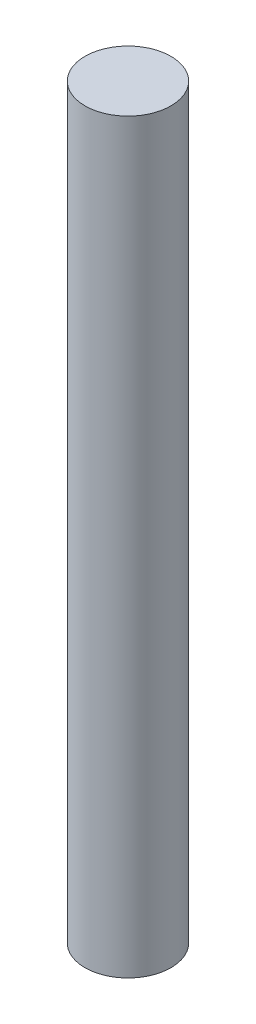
ISO-10303-21;
HEADER;
FILE_DESCRIPTION(('STEP AP214'),'2;1');
FILE_NAME('part.step','',(''),(''),'','','');
FILE_SCHEMA(('AUTOMOTIVE_DESIGN { 1 0 10303 214 1 1 1 1 }'));
ENDSEC;
DATA;
#1=APPLICATION_CONTEXT('core data for automotive mechanical design processes');
#2=APPLICATION_PROTOCOL_DEFINITION('international standard','automotive_design',2000,#1);
#3=PRODUCT_CONTEXT('',#1,'mechanical');
#4=PRODUCT('Part','Part','',(#3));
#5=PRODUCT_RELATED_PRODUCT_CATEGORY('part','',(#4));
#6=PRODUCT_DEFINITION_FORMATION('','',#4);
#7=PRODUCT_DEFINITION_CONTEXT('part definition',#1,'design');
#8=PRODUCT_DEFINITION('design','',#6,#7);
#9=PRODUCT_DEFINITION_SHAPE('','',#8);
#10=(LENGTH_UNIT() NAMED_UNIT(*) SI_UNIT(.MILLI.,.METRE.));
#11=(NAMED_UNIT(*) PLANE_ANGLE_UNIT() SI_UNIT($,.RADIAN.));
#12=(NAMED_UNIT(*) SI_UNIT($,.STERADIAN.) SOLID_ANGLE_UNIT());
#13=UNCERTAINTY_MEASURE_WITH_UNIT(LENGTH_MEASURE(1.E-05),#10,'distance_accuracy_value','');
#14=(GEOMETRIC_REPRESENTATION_CONTEXT(3) GLOBAL_UNCERTAINTY_ASSIGNED_CONTEXT((#13)) GLOBAL_UNIT_ASSIGNED_CONTEXT((#10,
#11,#12)) REPRESENTATION_CONTEXT('',''));
#15=CARTESIAN_POINT('',(0.,0.,0.));
#16=DIRECTION('',(0.,0.,1.));
#17=DIRECTION('',(1.,0.,0.));
#18=AXIS2_PLACEMENT_3D('',#15,#16,#17);
#19=CARTESIAN_POINT('',(0.,220.6625,0.));
#20=DIRECTION('',(0.,-1.,0.));
#21=DIRECTION('',(0.,0.,-1.));
#22=AXIS2_PLACEMENT_3D('',#19,#20,#21);
#23=CYLINDRICAL_SURFACE('',#22,12.7);
#24=CARTESIAN_POINT('',(0.,220.6625,0.));
#25=DIRECTION('',(0.,1.,0.));
#26=DIRECTION('',(0.,0.,1.));
#27=AXIS2_PLACEMENT_3D('',#24,#25,#26);
#28=CIRCLE('',#27,12.7);
#29=CARTESIAN_POINT('',(0.,220.6625,12.7));
#30=VERTEX_POINT('',#29);
#31=EDGE_CURVE('E10',#30,#30,#28,.T.);
#32=ORIENTED_EDGE('',*,*,#31,.F.);
#33=EDGE_LOOP('',(#32));
#34=FACE_BOUND('',#33,.T.);
#35=CARTESIAN_POINT('',(0.,0.,0.));
#36=DIRECTION('',(0.,1.,0.));
#37=DIRECTION('',(0.,0.,1.));
#38=AXIS2_PLACEMENT_3D('',#35,#36,#37);
#39=CIRCLE('',#38,12.7);
#40=CARTESIAN_POINT('',(0.,0.,12.7));
#41=VERTEX_POINT('',#40);
#42=EDGE_CURVE('E35',#41,#41,#39,.T.);
#43=ORIENTED_EDGE('',*,*,#42,.T.);
#44=EDGE_LOOP('',(#43));
#45=FACE_BOUND('',#44,.T.);
#46=ADVANCED_FACE('F32',(#34,#45),#23,.T.);
#47=CARTESIAN_POINT('',(0.,220.6625,0.));
#48=DIRECTION('',(0.,1.,0.));
#49=DIRECTION('',(0.,0.,1.));
#50=AXIS2_PLACEMENT_3D('',#47,#48,#49);
#51=PLANE('',#50);
#52=ORIENTED_EDGE('',*,*,#31,.T.);
#53=EDGE_LOOP('',(#52));
#54=FACE_BOUND('',#53,.T.);
#55=ADVANCED_FACE('F47',(#54),#51,.T.);
#56=CARTESIAN_POINT('',(0.,0.,0.));
#57=DIRECTION('',(0.,1.,0.));
#58=DIRECTION('',(0.,0.,1.));
#59=AXIS2_PLACEMENT_3D('',#56,#57,#58);
#60=PLANE('',#59);
#61=ORIENTED_EDGE('',*,*,#42,.F.);
#62=EDGE_LOOP('',(#61));
#63=FACE_BOUND('',#62,.T.);
#64=ADVANCED_FACE('F45',(#63),#60,.F.);
#65=CLOSED_SHELL('',(#46,#55,#64));
#66=MANIFOLD_SOLID_BREP('B2',#65);
#67=ADVANCED_BREP_SHAPE_REPRESENTATION('',(#18,#66),#14);
#68=SHAPE_DEFINITION_REPRESENTATION(#9,#67);
ENDSEC;
END-ISO-10303-21;
